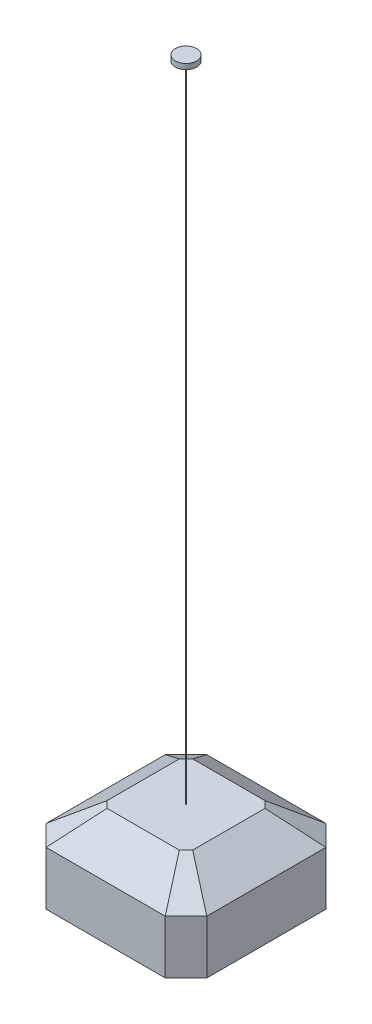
ISO-10303-21;
HEADER;
FILE_DESCRIPTION(('STEP AP214'),'2;1');
FILE_NAME('part.step','',(''),(''),'','','');
FILE_SCHEMA(('AUTOMOTIVE_DESIGN { 1 0 10303 214 1 1 1 1 }'));
ENDSEC;
DATA;
#1=APPLICATION_CONTEXT('core data for automotive mechanical design processes');
#2=APPLICATION_PROTOCOL_DEFINITION('international standard','automotive_design',2000,#1);
#3=PRODUCT_CONTEXT('',#1,'mechanical');
#4=PRODUCT('Part','Part','',(#3));
#5=PRODUCT_RELATED_PRODUCT_CATEGORY('part','',(#4));
#6=PRODUCT_DEFINITION_FORMATION('','',#4);
#7=PRODUCT_DEFINITION_CONTEXT('part definition',#1,'design');
#8=PRODUCT_DEFINITION('design','',#6,#7);
#9=PRODUCT_DEFINITION_SHAPE('','',#8);
#10=(LENGTH_UNIT() NAMED_UNIT(*) SI_UNIT(.MILLI.,.METRE.));
#11=(NAMED_UNIT(*) PLANE_ANGLE_UNIT() SI_UNIT($,.RADIAN.));
#12=(NAMED_UNIT(*) SI_UNIT($,.STERADIAN.) SOLID_ANGLE_UNIT());
#13=UNCERTAINTY_MEASURE_WITH_UNIT(LENGTH_MEASURE(1.E-05),#10,'distance_accuracy_value','');
#14=(GEOMETRIC_REPRESENTATION_CONTEXT(3) GLOBAL_UNCERTAINTY_ASSIGNED_CONTEXT((#13)) GLOBAL_UNIT_ASSIGNED_CONTEXT((#10,
#11,#12)) REPRESENTATION_CONTEXT('',''));
#15=CARTESIAN_POINT('',(0.,0.,0.));
#16=DIRECTION('',(0.,0.,1.));
#17=DIRECTION('',(1.,0.,0.));
#18=AXIS2_PLACEMENT_3D('',#15,#16,#17);
#19=CARTESIAN_POINT('',(0.,0.,0.));
#20=DIRECTION('',(0.,1.,0.));
#21=DIRECTION('',(0.,0.,1.));
#22=AXIS2_PLACEMENT_3D('',#19,#20,#21);
#23=PLANE('',#22);
#24=DIRECTION('',(-0.707106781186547,0.,-0.707106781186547));
#25=VECTOR('',#24,1.);
#26=CARTESIAN_POINT('',(160.,0.,-135.));
#27=LINE('',#26,#25);
#28=CARTESIAN_POINT('',(160.,0.,-135.));
#29=VERTEX_POINT('',#28);
#30=CARTESIAN_POINT('',(135.,0.,-160.));
#31=VERTEX_POINT('',#30);
#32=EDGE_CURVE('E412',#29,#31,#27,.T.);
#33=ORIENTED_EDGE('',*,*,#32,.F.);
#34=DIRECTION('',(0.,0.,-1.));
#35=VECTOR('',#34,1.);
#36=CARTESIAN_POINT('',(160.,0.,135.));
#37=LINE('',#36,#35);
#38=CARTESIAN_POINT('',(160.,0.,135.));
#39=VERTEX_POINT('',#38);
#40=EDGE_CURVE('E751',#39,#29,#37,.T.);
#41=ORIENTED_EDGE('',*,*,#40,.F.);
#42=DIRECTION('',(0.707106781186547,0.,-0.707106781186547));
#43=VECTOR('',#42,1.);
#44=CARTESIAN_POINT('',(135.,0.,160.));
#45=LINE('',#44,#43);
#46=CARTESIAN_POINT('',(135.,0.,160.));
#47=VERTEX_POINT('',#46);
#48=EDGE_CURVE('E854',#47,#39,#45,.T.);
#49=ORIENTED_EDGE('',*,*,#48,.F.);
#50=DIRECTION('',(1.,0.,0.));
#51=VECTOR('',#50,1.);
#52=CARTESIAN_POINT('',(-135.,0.,160.));
#53=LINE('',#52,#51);
#54=CARTESIAN_POINT('',(-135.,0.,160.));
#55=VERTEX_POINT('',#54);
#56=EDGE_CURVE('E871',#55,#47,#53,.T.);
#57=ORIENTED_EDGE('',*,*,#56,.F.);
#58=DIRECTION('',(0.707106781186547,0.,0.707106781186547));
#59=VECTOR('',#58,1.);
#60=CARTESIAN_POINT('',(-160.,0.,135.));
#61=LINE('',#60,#59);
#62=CARTESIAN_POINT('',(-160.,0.,135.));
#63=VERTEX_POINT('',#62);
#64=EDGE_CURVE('E875',#63,#55,#61,.T.);
#65=ORIENTED_EDGE('',*,*,#64,.F.);
#66=DIRECTION('',(0.,0.,1.));
#67=VECTOR('',#66,1.);
#68=CARTESIAN_POINT('',(-160.,0.,-135.));
#69=LINE('',#68,#67);
#70=CARTESIAN_POINT('',(-160.,0.,-135.));
#71=VERTEX_POINT('',#70);
#72=EDGE_CURVE('E893',#71,#63,#69,.T.);
#73=ORIENTED_EDGE('',*,*,#72,.F.);
#74=DIRECTION('',(-0.707106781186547,0.,0.707106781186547));
#75=VECTOR('',#74,1.);
#76=CARTESIAN_POINT('',(-135.,0.,-160.));
#77=LINE('',#76,#75);
#78=CARTESIAN_POINT('',(-135.,0.,-160.));
#79=VERTEX_POINT('',#78);
#80=EDGE_CURVE('E897',#79,#71,#77,.T.);
#81=ORIENTED_EDGE('',*,*,#80,.F.);
#82=DIRECTION('',(-1.,0.,0.));
#83=VECTOR('',#82,1.);
#84=CARTESIAN_POINT('',(135.,0.,-160.));
#85=LINE('',#84,#83);
#86=EDGE_CURVE('E754',#31,#79,#85,.T.);
#87=ORIENTED_EDGE('',*,*,#86,.F.);
#88=EDGE_LOOP('',(#33,#41,#49,#57,#65,#73,#81,#87));
#89=FACE_BOUND('',#88,.T.);
#90=ADVANCED_FACE('F89',(#89),#23,.F.);
#91=CARTESIAN_POINT('',(-41.1260485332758,-93.5386582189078,-41.1260485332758));
#92=DIRECTION('',(0.373376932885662,0.849222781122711,0.373376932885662));
#93=DIRECTION('',(0.,-0.402484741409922,0.915426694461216));
#94=AXIS2_PLACEMENT_3D('',#91,#92,#93);
#95=PLANE('',#94);
#96=DIRECTION('',(-0.72541369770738,0.518152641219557,-0.453092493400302));
#97=VECTOR('',#96,1.);
#98=CARTESIAN_POINT('',(-160.,0.,-135.));
#99=LINE('',#98,#97);
#100=CARTESIAN_POINT('',(-300.,100.,-222.443825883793));
#101=VERTEX_POINT('',#100);
#102=EDGE_CURVE('E853',#71,#101,#99,.T.);
#103=ORIENTED_EDGE('',*,*,#102,.T.);
#104=DIRECTION('',(-0.707106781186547,0.,0.707106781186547));
#105=VECTOR('',#104,1.);
#106=CARTESIAN_POINT('',(-222.443825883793,100.,-300.));
#107=LINE('',#106,#105);
#108=CARTESIAN_POINT('',(-222.443825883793,100.,-300.));
#109=VERTEX_POINT('',#108);
#110=EDGE_CURVE('E794',#109,#101,#107,.T.);
#111=ORIENTED_EDGE('',*,*,#110,.F.);
#112=DIRECTION('',(-0.453092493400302,0.518152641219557,-0.72541369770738));
#113=VECTOR('',#112,1.);
#114=CARTESIAN_POINT('',(-135.,0.,-160.));
#115=LINE('',#114,#113);
#116=EDGE_CURVE('E925',#79,#109,#115,.T.);
#117=ORIENTED_EDGE('',*,*,#116,.F.);
#118=ORIENTED_EDGE('',*,*,#80,.T.);
#119=EDGE_LOOP('',(#103,#111,#117,#118));
#120=FACE_BOUND('',#119,.T.);
#121=ADVANCED_FACE('F740',(#120),#95,.F.);
#122=CARTESIAN_POINT('',(0.,-75.6756756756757,-54.0540540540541));
#123=DIRECTION('',(0.,0.813733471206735,0.581238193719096));
#124=DIRECTION('',(0.,-0.581238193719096,0.813733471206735));
#125=AXIS2_PLACEMENT_3D('',#122,#123,#124);
#126=PLANE('',#125);
#127=ORIENTED_EDGE('',*,*,#116,.T.);
#128=DIRECTION('',(-1.,0.,0.));
#129=VECTOR('',#128,1.);
#130=CARTESIAN_POINT('',(222.443825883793,100.,-300.));
#131=LINE('',#130,#129);
#132=CARTESIAN_POINT('',(222.443825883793,100.,-300.));
#133=VERTEX_POINT('',#132);
#134=EDGE_CURVE('E117',#133,#109,#131,.T.);
#135=ORIENTED_EDGE('',*,*,#134,.F.);
#136=DIRECTION('',(0.453092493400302,0.518152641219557,-0.72541369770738));
#137=VECTOR('',#136,1.);
#138=CARTESIAN_POINT('',(135.,0.,-160.));
#139=LINE('',#138,#137);
#140=EDGE_CURVE('E808',#31,#133,#139,.T.);
#141=ORIENTED_EDGE('',*,*,#140,.F.);
#142=ORIENTED_EDGE('',*,*,#86,.T.);
#143=EDGE_LOOP('',(#127,#135,#141,#142));
#144=FACE_BOUND('',#143,.T.);
#145=ADVANCED_FACE('F745',(#144),#126,.F.);
#146=CARTESIAN_POINT('',(-54.054054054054,-75.6756756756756,0.));
#147=DIRECTION('',(0.581238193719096,0.813733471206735,0.));
#148=DIRECTION('',(-0.813733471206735,0.581238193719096,0.));
#149=AXIS2_PLACEMENT_3D('',#146,#147,#148);
#150=PLANE('',#149);
#151=DIRECTION('',(-0.72541369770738,0.518152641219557,0.453092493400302));
#152=VECTOR('',#151,1.);
#153=CARTESIAN_POINT('',(-160.,0.,135.));
#154=LINE('',#153,#152);
#155=CARTESIAN_POINT('',(-300.,100.,222.443825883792));
#156=VERTEX_POINT('',#155);
#157=EDGE_CURVE('E929',#63,#156,#154,.T.);
#158=ORIENTED_EDGE('',*,*,#157,.T.);
#159=DIRECTION('',(0.,0.,1.));
#160=VECTOR('',#159,1.);
#161=CARTESIAN_POINT('',(-300.,100.,-222.443825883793));
#162=LINE('',#161,#160);
#163=EDGE_CURVE('E788',#101,#156,#162,.T.);
#164=ORIENTED_EDGE('',*,*,#163,.F.);
#165=ORIENTED_EDGE('',*,*,#102,.F.);
#166=ORIENTED_EDGE('',*,*,#72,.T.);
#167=EDGE_LOOP('',(#158,#164,#165,#166));
#168=FACE_BOUND('',#167,.T.);
#169=ADVANCED_FACE('F955',(#168),#150,.F.);
#170=CARTESIAN_POINT('',(-41.1260485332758,-93.5386582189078,41.1260485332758));
#171=DIRECTION('',(0.373376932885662,0.84922278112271,-0.373376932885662));
#172=DIRECTION('',(0.,0.402484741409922,0.915426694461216));
#173=AXIS2_PLACEMENT_3D('',#170,#171,#172);
#174=PLANE('',#173);
#175=DIRECTION('',(-0.453092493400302,0.518152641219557,0.72541369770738));
#176=VECTOR('',#175,1.);
#177=CARTESIAN_POINT('',(-135.,0.,160.));
#178=LINE('',#177,#176);
#179=CARTESIAN_POINT('',(-222.443825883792,100.,300.));
#180=VERTEX_POINT('',#179);
#181=EDGE_CURVE('E934',#55,#180,#178,.T.);
#182=ORIENTED_EDGE('',*,*,#181,.T.);
#183=DIRECTION('',(0.707106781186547,0.,0.707106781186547));
#184=VECTOR('',#183,1.);
#185=CARTESIAN_POINT('',(-300.,100.,222.443825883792));
#186=LINE('',#185,#184);
#187=EDGE_CURVE('E782',#156,#180,#186,.T.);
#188=ORIENTED_EDGE('',*,*,#187,.F.);
#189=ORIENTED_EDGE('',*,*,#157,.F.);
#190=ORIENTED_EDGE('',*,*,#64,.T.);
#191=EDGE_LOOP('',(#182,#188,#189,#190));
#192=FACE_BOUND('',#191,.T.);
#193=ADVANCED_FACE('F958',(#192),#174,.F.);
#194=CARTESIAN_POINT('',(0.,-75.6756756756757,54.0540540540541));
#195=DIRECTION('',(0.,0.813733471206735,-0.581238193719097));
#196=DIRECTION('',(0.,0.581238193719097,0.813733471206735));
#197=AXIS2_PLACEMENT_3D('',#194,#195,#196);
#198=PLANE('',#197);
#199=DIRECTION('',(0.453092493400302,0.518152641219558,0.72541369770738));
#200=VECTOR('',#199,1.);
#201=CARTESIAN_POINT('',(135.,0.,160.));
#202=LINE('',#201,#200);
#203=CARTESIAN_POINT('',(222.443825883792,100.,300.));
#204=VERTEX_POINT('',#203);
#205=EDGE_CURVE('E988',#47,#204,#202,.T.);
#206=ORIENTED_EDGE('',*,*,#205,.T.);
#207=DIRECTION('',(1.,0.,0.));
#208=VECTOR('',#207,1.);
#209=CARTESIAN_POINT('',(-222.443825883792,100.,300.));
#210=LINE('',#209,#208);
#211=EDGE_CURVE('E776',#180,#204,#210,.T.);
#212=ORIENTED_EDGE('',*,*,#211,.F.);
#213=ORIENTED_EDGE('',*,*,#181,.F.);
#214=ORIENTED_EDGE('',*,*,#56,.T.);
#215=EDGE_LOOP('',(#206,#212,#213,#214));
#216=FACE_BOUND('',#215,.T.);
#217=ADVANCED_FACE('F833',(#216),#198,.F.);
#218=CARTESIAN_POINT('',(41.1260485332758,-93.5386582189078,41.1260485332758));
#219=DIRECTION('',(-0.373376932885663,0.84922278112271,-0.373376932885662));
#220=DIRECTION('',(-0.915426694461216,-0.402484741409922,0.));
#221=AXIS2_PLACEMENT_3D('',#218,#219,#220);
#222=PLANE('',#221);
#223=DIRECTION('',(0.72541369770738,0.518152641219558,0.453092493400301));
#224=VECTOR('',#223,1.);
#225=CARTESIAN_POINT('',(160.,0.,135.));
#226=LINE('',#225,#224);
#227=CARTESIAN_POINT('',(300.,100.,222.443825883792));
#228=VERTEX_POINT('',#227);
#229=EDGE_CURVE('E109',#39,#228,#226,.T.);
#230=ORIENTED_EDGE('',*,*,#229,.T.);
#231=DIRECTION('',(0.707106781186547,0.,-0.707106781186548));
#232=VECTOR('',#231,1.);
#233=CARTESIAN_POINT('',(222.443825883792,100.,300.));
#234=LINE('',#233,#232);
#235=EDGE_CURVE('E101',#204,#228,#234,.T.);
#236=ORIENTED_EDGE('',*,*,#235,.F.);
#237=ORIENTED_EDGE('',*,*,#205,.F.);
#238=ORIENTED_EDGE('',*,*,#48,.T.);
#239=EDGE_LOOP('',(#230,#236,#237,#238));
#240=FACE_BOUND('',#239,.T.);
#241=ADVANCED_FACE('F829',(#240),#222,.F.);
#242=CARTESIAN_POINT('',(54.054054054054,-75.6756756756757,0.));
#243=DIRECTION('',(-0.581238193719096,0.813733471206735,0.));
#244=DIRECTION('',(-0.813733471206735,-0.581238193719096,0.));
#245=AXIS2_PLACEMENT_3D('',#242,#243,#244);
#246=PLANE('',#245);
#247=DIRECTION('',(0.72541369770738,0.518152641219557,-0.453092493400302));
#248=VECTOR('',#247,1.);
#249=CARTESIAN_POINT('',(160.,0.,-135.));
#250=LINE('',#249,#248);
#251=CARTESIAN_POINT('',(300.,100.,-222.443825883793));
#252=VERTEX_POINT('',#251);
#253=EDGE_CURVE('E1006',#29,#252,#250,.T.);
#254=ORIENTED_EDGE('',*,*,#253,.T.);
#255=DIRECTION('',(0.,0.,-1.));
#256=VECTOR('',#255,1.);
#257=CARTESIAN_POINT('',(300.,100.,222.443825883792));
#258=LINE('',#257,#256);
#259=EDGE_CURVE('E12',#228,#252,#258,.T.);
#260=ORIENTED_EDGE('',*,*,#259,.F.);
#261=ORIENTED_EDGE('',*,*,#229,.F.);
#262=ORIENTED_EDGE('',*,*,#40,.T.);
#263=EDGE_LOOP('',(#254,#260,#261,#262));
#264=FACE_BOUND('',#263,.T.);
#265=ADVANCED_FACE('F820',(#264),#246,.F.);
#266=CARTESIAN_POINT('',(41.1260485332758,-93.5386582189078,-41.1260485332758));
#267=DIRECTION('',(-0.373376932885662,0.849222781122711,0.373376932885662));
#268=DIRECTION('',(0.,-0.402484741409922,0.915426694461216));
#269=AXIS2_PLACEMENT_3D('',#266,#267,#268);
#270=PLANE('',#269);
#271=ORIENTED_EDGE('',*,*,#140,.T.);
#272=DIRECTION('',(-0.707106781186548,0.,-0.707106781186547));
#273=VECTOR('',#272,1.);
#274=CARTESIAN_POINT('',(300.,100.,-222.443825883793));
#275=LINE('',#274,#273);
#276=EDGE_CURVE('E258',#252,#133,#275,.T.);
#277=ORIENTED_EDGE('',*,*,#276,.F.);
#278=ORIENTED_EDGE('',*,*,#253,.F.);
#279=ORIENTED_EDGE('',*,*,#32,.T.);
#280=EDGE_LOOP('',(#271,#277,#278,#279));
#281=FACE_BOUND('',#280,.T.);
#282=ADVANCED_FACE('F91',(#281),#270,.F.);
#283=CARTESIAN_POINT('',(-300.,0.,0.));
#284=DIRECTION('',(-1.,0.,0.));
#285=DIRECTION('',(0.,0.,1.));
#286=AXIS2_PLACEMENT_3D('',#283,#284,#285);
#287=PLANE('',#286);
#288=DIRECTION('',(0.,1.,0.));
#289=VECTOR('',#288,1.);
#290=CARTESIAN_POINT('',(-300.,100.,222.443825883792));
#291=LINE('',#290,#289);
#292=CARTESIAN_POINT('',(-300.,300.,222.443825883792));
#293=VERTEX_POINT('',#292);
#294=EDGE_CURVE('E279',#156,#293,#291,.T.);
#295=ORIENTED_EDGE('',*,*,#294,.T.);
#296=DIRECTION('',(0.,0.,-1.));
#297=VECTOR('',#296,1.);
#298=CARTESIAN_POINT('',(-300.,300.,222.443825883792));
#299=LINE('',#298,#297);
#300=CARTESIAN_POINT('',(-300.,300.,-222.443825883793));
#301=VERTEX_POINT('',#300);
#302=EDGE_CURVE('E413',#293,#301,#299,.T.);
#303=ORIENTED_EDGE('',*,*,#302,.T.);
#304=DIRECTION('',(0.,1.,0.));
#305=VECTOR('',#304,1.);
#306=CARTESIAN_POINT('',(-300.,100.,-222.443825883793));
#307=LINE('',#306,#305);
#308=EDGE_CURVE('E274',#101,#301,#307,.T.);
#309=ORIENTED_EDGE('',*,*,#308,.F.);
#310=ORIENTED_EDGE('',*,*,#163,.T.);
#311=EDGE_LOOP('',(#295,#303,#309,#310));
#312=FACE_BOUND('',#311,.T.);
#313=ADVANCED_FACE('F314',(#312),#287,.T.);
#314=CARTESIAN_POINT('',(-261.221912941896,0.,-261.221912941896));
#315=DIRECTION('',(-0.707106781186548,0.,-0.707106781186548));
#316=DIRECTION('',(-0.707106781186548,0.,0.707106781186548));
#317=AXIS2_PLACEMENT_3D('',#314,#315,#316);
#318=PLANE('',#317);
#319=ORIENTED_EDGE('',*,*,#308,.T.);
#320=DIRECTION('',(0.707106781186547,0.,-0.707106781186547));
#321=VECTOR('',#320,1.);
#322=CARTESIAN_POINT('',(-300.,300.,-222.443825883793));
#323=LINE('',#322,#321);
#324=CARTESIAN_POINT('',(-222.443825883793,300.,-300.));
#325=VERTEX_POINT('',#324);
#326=EDGE_CURVE('E296',#301,#325,#323,.T.);
#327=ORIENTED_EDGE('',*,*,#326,.T.);
#328=DIRECTION('',(0.,1.,0.));
#329=VECTOR('',#328,1.);
#330=CARTESIAN_POINT('',(-222.443825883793,100.,-300.));
#331=LINE('',#330,#329);
#332=EDGE_CURVE('E249',#109,#325,#331,.T.);
#333=ORIENTED_EDGE('',*,*,#332,.F.);
#334=ORIENTED_EDGE('',*,*,#110,.T.);
#335=EDGE_LOOP('',(#319,#327,#333,#334));
#336=FACE_BOUND('',#335,.T.);
#337=ADVANCED_FACE('F303',(#336),#318,.T.);
#338=CARTESIAN_POINT('',(-261.221912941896,0.,261.221912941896));
#339=DIRECTION('',(-0.707106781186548,0.,0.707106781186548));
#340=DIRECTION('',(0.707106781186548,0.,0.707106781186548));
#341=AXIS2_PLACEMENT_3D('',#338,#339,#340);
#342=PLANE('',#341);
#343=DIRECTION('',(0.,1.,0.));
#344=VECTOR('',#343,1.);
#345=CARTESIAN_POINT('',(-222.443825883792,100.,300.));
#346=LINE('',#345,#344);
#347=CARTESIAN_POINT('',(-222.443825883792,300.,300.));
#348=VERTEX_POINT('',#347);
#349=EDGE_CURVE('E278',#180,#348,#346,.T.);
#350=ORIENTED_EDGE('',*,*,#349,.T.);
#351=DIRECTION('',(-0.707106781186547,0.,-0.707106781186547));
#352=VECTOR('',#351,1.);
#353=CARTESIAN_POINT('',(-222.443825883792,300.,300.));
#354=LINE('',#353,#352);
#355=EDGE_CURVE('E416',#348,#293,#354,.T.);
#356=ORIENTED_EDGE('',*,*,#355,.T.);
#357=ORIENTED_EDGE('',*,*,#294,.F.);
#358=ORIENTED_EDGE('',*,*,#187,.T.);
#359=EDGE_LOOP('',(#350,#356,#357,#358));
#360=FACE_BOUND('',#359,.T.);
#361=ADVANCED_FACE('F313',(#360),#342,.T.);
#362=CARTESIAN_POINT('',(0.,0.,300.));
#363=DIRECTION('',(0.,0.,1.));
#364=DIRECTION('',(1.,0.,0.));
#365=AXIS2_PLACEMENT_3D('',#362,#363,#364);
#366=PLANE('',#365);
#367=DIRECTION('',(0.,1.,0.));
#368=VECTOR('',#367,1.);
#369=CARTESIAN_POINT('',(222.443825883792,100.,300.));
#370=LINE('',#369,#368);
#371=CARTESIAN_POINT('',(222.443825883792,300.,300.));
#372=VERTEX_POINT('',#371);
#373=EDGE_CURVE('E291',#204,#372,#370,.T.);
#374=ORIENTED_EDGE('',*,*,#373,.T.);
#375=DIRECTION('',(-1.,0.,0.));
#376=VECTOR('',#375,1.);
#377=CARTESIAN_POINT('',(222.443825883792,300.,300.));
#378=LINE('',#377,#376);
#379=EDGE_CURVE('E340',#372,#348,#378,.T.);
#380=ORIENTED_EDGE('',*,*,#379,.T.);
#381=ORIENTED_EDGE('',*,*,#349,.F.);
#382=ORIENTED_EDGE('',*,*,#211,.T.);
#383=EDGE_LOOP('',(#374,#380,#381,#382));
#384=FACE_BOUND('',#383,.T.);
#385=ADVANCED_FACE('F320',(#384),#366,.T.);
#386=CARTESIAN_POINT('',(261.221912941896,0.,261.221912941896));
#387=DIRECTION('',(0.707106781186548,0.,0.707106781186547));
#388=DIRECTION('',(0.707106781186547,0.,-0.707106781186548));
#389=AXIS2_PLACEMENT_3D('',#386,#387,#388);
#390=PLANE('',#389);
#391=DIRECTION('',(0.,1.,0.));
#392=VECTOR('',#391,1.);
#393=CARTESIAN_POINT('',(300.,100.,222.443825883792));
#394=LINE('',#393,#392);
#395=CARTESIAN_POINT('',(300.,300.,222.443825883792));
#396=VERTEX_POINT('',#395);
#397=EDGE_CURVE('E265',#228,#396,#394,.T.);
#398=ORIENTED_EDGE('',*,*,#397,.T.);
#399=DIRECTION('',(-0.707106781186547,0.,0.707106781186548));
#400=VECTOR('',#399,1.);
#401=CARTESIAN_POINT('',(300.,300.,222.443825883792));
#402=LINE('',#401,#400);
#403=EDGE_CURVE('E354',#396,#372,#402,.T.);
#404=ORIENTED_EDGE('',*,*,#403,.T.);
#405=ORIENTED_EDGE('',*,*,#373,.F.);
#406=ORIENTED_EDGE('',*,*,#235,.T.);
#407=EDGE_LOOP('',(#398,#404,#405,#406));
#408=FACE_BOUND('',#407,.T.);
#409=ADVANCED_FACE('F360',(#408),#390,.T.);
#410=CARTESIAN_POINT('',(300.,0.,1.1229809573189E-13));
#411=DIRECTION('',(1.,0.,0.));
#412=DIRECTION('',(0.,0.,-1.));
#413=AXIS2_PLACEMENT_3D('',#410,#411,#412);
#414=PLANE('',#413);
#415=DIRECTION('',(0.,1.,0.));
#416=VECTOR('',#415,1.);
#417=CARTESIAN_POINT('',(300.,100.,-222.443825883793));
#418=LINE('',#417,#416);
#419=CARTESIAN_POINT('',(300.,300.,-222.443825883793));
#420=VERTEX_POINT('',#419);
#421=EDGE_CURVE('E260',#252,#420,#418,.T.);
#422=ORIENTED_EDGE('',*,*,#421,.T.);
#423=DIRECTION('',(0.,0.,1.));
#424=VECTOR('',#423,1.);
#425=CARTESIAN_POINT('',(300.,300.,-222.443825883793));
#426=LINE('',#425,#424);
#427=EDGE_CURVE('E94',#420,#396,#426,.T.);
#428=ORIENTED_EDGE('',*,*,#427,.T.);
#429=ORIENTED_EDGE('',*,*,#397,.F.);
#430=ORIENTED_EDGE('',*,*,#259,.T.);
#431=EDGE_LOOP('',(#422,#428,#429,#430));
#432=FACE_BOUND('',#431,.T.);
#433=ADVANCED_FACE('F369',(#432),#414,.T.);
#434=CARTESIAN_POINT('',(261.221912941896,0.,-261.221912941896));
#435=DIRECTION('',(0.707106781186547,0.,-0.707106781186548));
#436=DIRECTION('',(-0.707106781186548,0.,-0.707106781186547));
#437=AXIS2_PLACEMENT_3D('',#434,#435,#436);
#438=PLANE('',#437);
#439=DIRECTION('',(0.,1.,0.));
#440=VECTOR('',#439,1.);
#441=CARTESIAN_POINT('',(222.443825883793,100.,-300.));
#442=LINE('',#441,#440);
#443=CARTESIAN_POINT('',(222.443825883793,300.,-300.));
#444=VERTEX_POINT('',#443);
#445=EDGE_CURVE('E247',#133,#444,#442,.T.);
#446=ORIENTED_EDGE('',*,*,#445,.T.);
#447=DIRECTION('',(0.707106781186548,0.,0.707106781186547));
#448=VECTOR('',#447,1.);
#449=CARTESIAN_POINT('',(222.443825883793,300.,-300.));
#450=LINE('',#449,#448);
#451=EDGE_CURVE('E211',#444,#420,#450,.T.);
#452=ORIENTED_EDGE('',*,*,#451,.T.);
#453=ORIENTED_EDGE('',*,*,#421,.F.);
#454=ORIENTED_EDGE('',*,*,#276,.T.);
#455=EDGE_LOOP('',(#446,#452,#453,#454));
#456=FACE_BOUND('',#455,.T.);
#457=ADVANCED_FACE('F256',(#456),#438,.T.);
#458=CARTESIAN_POINT('',(0.,0.,-300.));
#459=DIRECTION('',(0.,0.,-1.));
#460=DIRECTION('',(0.,1.,0.));
#461=AXIS2_PLACEMENT_3D('',#458,#459,#460);
#462=PLANE('',#461);
#463=ORIENTED_EDGE('',*,*,#332,.T.);
#464=DIRECTION('',(1.,0.,0.));
#465=VECTOR('',#464,1.);
#466=CARTESIAN_POINT('',(-222.443825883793,300.,-300.));
#467=LINE('',#466,#465);
#468=EDGE_CURVE('E226',#325,#444,#467,.T.);
#469=ORIENTED_EDGE('',*,*,#468,.T.);
#470=ORIENTED_EDGE('',*,*,#445,.F.);
#471=ORIENTED_EDGE('',*,*,#134,.T.);
#472=EDGE_LOOP('',(#463,#469,#470,#471));
#473=FACE_BOUND('',#472,.T.);
#474=ADVANCED_FACE('F246',(#473),#462,.T.);
#475=CARTESIAN_POINT('',(0.,400.,0.));
#476=DIRECTION('',(0.,1.,0.));
#477=DIRECTION('',(0.,0.,1.));
#478=AXIS2_PLACEMENT_3D('',#475,#476,#477);
#479=PLANE('',#478);
#480=CARTESIAN_POINT('',(0.,400.,0.));
#481=DIRECTION('',(0.,-1.,0.));
#482=DIRECTION('',(1.,0.,0.));
#483=AXIS2_PLACEMENT_3D('',#480,#481,#482);
#484=CIRCLE('',#483,1.00000000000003);
#485=CARTESIAN_POINT('',(1.00000000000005,400.,0.));
#486=VERTEX_POINT('',#485);
#487=EDGE_CURVE('E698',#486,#486,#484,.T.);
#488=ORIENTED_EDGE('',*,*,#487,.T.);
#489=EDGE_LOOP('',(#488));
#490=FACE_BOUND('',#489,.T.);
#491=DIRECTION('',(-0.707106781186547,0.,-0.707106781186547));
#492=VECTOR('',#491,1.);
#493=CARTESIAN_POINT('',(160.,400.,-135.));
#494=LINE('',#493,#492);
#495=CARTESIAN_POINT('',(160.,400.,-135.));
#496=VERTEX_POINT('',#495);
#497=CARTESIAN_POINT('',(135.,400.,-160.));
#498=VERTEX_POINT('',#497);
#499=EDGE_CURVE('E507',#496,#498,#494,.T.);
#500=ORIENTED_EDGE('',*,*,#499,.T.);
#501=DIRECTION('',(-1.,0.,0.));
#502=VECTOR('',#501,1.);
#503=CARTESIAN_POINT('',(135.,400.,-160.));
#504=LINE('',#503,#502);
#505=CARTESIAN_POINT('',(-135.,400.,-160.));
#506=VERTEX_POINT('',#505);
#507=EDGE_CURVE('E237',#498,#506,#504,.T.);
#508=ORIENTED_EDGE('',*,*,#507,.T.);
#509=DIRECTION('',(-0.707106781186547,0.,0.707106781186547));
#510=VECTOR('',#509,1.);
#511=CARTESIAN_POINT('',(-135.,400.,-160.));
#512=LINE('',#511,#510);
#513=CARTESIAN_POINT('',(-160.,400.,-135.));
#514=VERTEX_POINT('',#513);
#515=EDGE_CURVE('E506',#506,#514,#512,.T.);
#516=ORIENTED_EDGE('',*,*,#515,.T.);
#517=DIRECTION('',(0.,0.,1.));
#518=VECTOR('',#517,1.);
#519=CARTESIAN_POINT('',(-160.,400.,-135.));
#520=LINE('',#519,#518);
#521=CARTESIAN_POINT('',(-160.,400.,135.));
#522=VERTEX_POINT('',#521);
#523=EDGE_CURVE('E512',#514,#522,#520,.T.);
#524=ORIENTED_EDGE('',*,*,#523,.T.);
#525=DIRECTION('',(0.707106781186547,0.,0.707106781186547));
#526=VECTOR('',#525,1.);
#527=CARTESIAN_POINT('',(-160.,400.,135.));
#528=LINE('',#527,#526);
#529=CARTESIAN_POINT('',(-135.,400.,160.));
#530=VERTEX_POINT('',#529);
#531=EDGE_CURVE('E579',#522,#530,#528,.T.);
#532=ORIENTED_EDGE('',*,*,#531,.T.);
#533=DIRECTION('',(1.,0.,0.));
#534=VECTOR('',#533,1.);
#535=CARTESIAN_POINT('',(-135.,400.,160.));
#536=LINE('',#535,#534);
#537=CARTESIAN_POINT('',(135.,400.,160.));
#538=VERTEX_POINT('',#537);
#539=EDGE_CURVE('E593',#530,#538,#536,.T.);
#540=ORIENTED_EDGE('',*,*,#539,.T.);
#541=DIRECTION('',(0.707106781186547,0.,-0.707106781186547));
#542=VECTOR('',#541,1.);
#543=CARTESIAN_POINT('',(135.,400.,160.));
#544=LINE('',#543,#542);
#545=CARTESIAN_POINT('',(160.,400.,135.));
#546=VERTEX_POINT('',#545);
#547=EDGE_CURVE('E1036',#538,#546,#544,.T.);
#548=ORIENTED_EDGE('',*,*,#547,.T.);
#549=DIRECTION('',(0.,0.,-1.));
#550=VECTOR('',#549,1.);
#551=CARTESIAN_POINT('',(160.,400.,135.));
#552=LINE('',#551,#550);
#553=EDGE_CURVE('E285',#546,#496,#552,.T.);
#554=ORIENTED_EDGE('',*,*,#553,.T.);
#555=EDGE_LOOP('',(#500,#508,#516,#524,#532,#540,#548,#554));
#556=FACE_BOUND('',#555,.T.);
#557=ADVANCED_FACE('F394',(#490,#556),#479,.T.);
#558=CARTESIAN_POINT('',(-243.243243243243,340.540540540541,0.));
#559=DIRECTION('',(0.581238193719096,-0.813733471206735,0.));
#560=DIRECTION('',(0.813733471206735,0.581238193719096,0.));
#561=AXIS2_PLACEMENT_3D('',#558,#559,#560);
#562=PLANE('',#561);
#563=DIRECTION('',(0.72541369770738,0.518152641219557,-0.453092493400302));
#564=VECTOR('',#563,1.);
#565=CARTESIAN_POINT('',(-300.,300.,222.443825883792));
#566=LINE('',#565,#564);
#567=EDGE_CURVE('E677',#293,#522,#566,.T.);
#568=ORIENTED_EDGE('',*,*,#567,.T.);
#569=ORIENTED_EDGE('',*,*,#523,.F.);
#570=DIRECTION('',(0.72541369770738,0.518152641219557,0.453092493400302));
#571=VECTOR('',#570,1.);
#572=CARTESIAN_POINT('',(-300.,300.,-222.443825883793));
#573=LINE('',#572,#571);
#574=EDGE_CURVE('E523',#301,#514,#573,.T.);
#575=ORIENTED_EDGE('',*,*,#574,.F.);
#576=ORIENTED_EDGE('',*,*,#302,.F.);
#577=EDGE_LOOP('',(#568,#569,#575,#576));
#578=FACE_BOUND('',#577,.T.);
#579=ADVANCED_FACE('F454',(#578),#562,.F.);
#580=CARTESIAN_POINT('',(-167.958127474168,382.010391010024,-167.958127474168));
#581=DIRECTION('',(0.373376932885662,-0.849222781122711,0.373376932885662));
#582=DIRECTION('',(0.,-0.402484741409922,-0.915426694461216));
#583=AXIS2_PLACEMENT_3D('',#580,#581,#582);
#584=PLANE('',#583);
#585=ORIENTED_EDGE('',*,*,#574,.T.);
#586=ORIENTED_EDGE('',*,*,#515,.F.);
#587=DIRECTION('',(0.453092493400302,0.518152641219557,0.72541369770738));
#588=VECTOR('',#587,1.);
#589=CARTESIAN_POINT('',(-222.443825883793,300.,-300.));
#590=LINE('',#589,#588);
#591=EDGE_CURVE('E240',#325,#506,#590,.T.);
#592=ORIENTED_EDGE('',*,*,#591,.F.);
#593=ORIENTED_EDGE('',*,*,#326,.F.);
#594=EDGE_LOOP('',(#585,#586,#592,#593));
#595=FACE_BOUND('',#594,.T.);
#596=ADVANCED_FACE('F521',(#595),#584,.F.);
#597=CARTESIAN_POINT('',(-167.958127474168,382.010391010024,167.958127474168));
#598=DIRECTION('',(0.373376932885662,-0.849222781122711,-0.373376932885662));
#599=DIRECTION('',(0.,0.402484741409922,-0.915426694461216));
#600=AXIS2_PLACEMENT_3D('',#597,#598,#599);
#601=PLANE('',#600);
#602=DIRECTION('',(0.453092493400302,0.518152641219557,-0.72541369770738));
#603=VECTOR('',#602,1.);
#604=CARTESIAN_POINT('',(-222.443825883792,300.,300.));
#605=LINE('',#604,#603);
#606=EDGE_CURVE('E626',#348,#530,#605,.T.);
#607=ORIENTED_EDGE('',*,*,#606,.T.);
#608=ORIENTED_EDGE('',*,*,#531,.F.);
#609=ORIENTED_EDGE('',*,*,#567,.F.);
#610=ORIENTED_EDGE('',*,*,#355,.F.);
#611=EDGE_LOOP('',(#607,#608,#609,#610));
#612=FACE_BOUND('',#611,.T.);
#613=ADVANCED_FACE('F550',(#612),#601,.F.);
#614=CARTESIAN_POINT('',(0.,340.540540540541,243.243243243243));
#615=DIRECTION('',(0.,-0.813733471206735,-0.581238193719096));
#616=DIRECTION('',(0.,0.581238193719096,-0.813733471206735));
#617=AXIS2_PLACEMENT_3D('',#614,#615,#616);
#618=PLANE('',#617);
#619=DIRECTION('',(-0.453092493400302,0.518152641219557,-0.72541369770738));
#620=VECTOR('',#619,1.);
#621=CARTESIAN_POINT('',(222.443825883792,300.,300.));
#622=LINE('',#621,#620);
#623=EDGE_CURVE('E617',#372,#538,#622,.T.);
#624=ORIENTED_EDGE('',*,*,#623,.T.);
#625=ORIENTED_EDGE('',*,*,#539,.F.);
#626=ORIENTED_EDGE('',*,*,#606,.F.);
#627=ORIENTED_EDGE('',*,*,#379,.F.);
#628=EDGE_LOOP('',(#624,#625,#626,#627));
#629=FACE_BOUND('',#628,.T.);
#630=ADVANCED_FACE('F598',(#629),#618,.F.);
#631=CARTESIAN_POINT('',(167.958127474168,382.010391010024,167.958127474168));
#632=DIRECTION('',(-0.373376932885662,-0.849222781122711,-0.373376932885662));
#633=DIRECTION('',(0.,0.402484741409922,-0.915426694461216));
#634=AXIS2_PLACEMENT_3D('',#631,#632,#633);
#635=PLANE('',#634);
#636=DIRECTION('',(-0.72541369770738,0.518152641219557,-0.453092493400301));
#637=VECTOR('',#636,1.);
#638=CARTESIAN_POINT('',(300.,300.,222.443825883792));
#639=LINE('',#638,#637);
#640=EDGE_CURVE('E625',#396,#546,#639,.T.);
#641=ORIENTED_EDGE('',*,*,#640,.T.);
#642=ORIENTED_EDGE('',*,*,#547,.F.);
#643=ORIENTED_EDGE('',*,*,#623,.F.);
#644=ORIENTED_EDGE('',*,*,#403,.F.);
#645=EDGE_LOOP('',(#641,#642,#643,#644));
#646=FACE_BOUND('',#645,.T.);
#647=ADVANCED_FACE('F607',(#646),#635,.F.);
#648=CARTESIAN_POINT('',(243.243243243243,340.540540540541,1.00020092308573E-13));
#649=DIRECTION('',(-0.581238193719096,-0.813733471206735,0.));
#650=DIRECTION('',(0.813733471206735,-0.581238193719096,0.));
#651=AXIS2_PLACEMENT_3D('',#648,#649,#650);
#652=PLANE('',#651);
#653=DIRECTION('',(-0.72541369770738,0.518152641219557,0.453092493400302));
#654=VECTOR('',#653,1.);
#655=CARTESIAN_POINT('',(300.,300.,-222.443825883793));
#656=LINE('',#655,#654);
#657=EDGE_CURVE('E219',#420,#496,#656,.T.);
#658=ORIENTED_EDGE('',*,*,#657,.T.);
#659=ORIENTED_EDGE('',*,*,#553,.F.);
#660=ORIENTED_EDGE('',*,*,#640,.F.);
#661=ORIENTED_EDGE('',*,*,#427,.F.);
#662=EDGE_LOOP('',(#658,#659,#660,#661));
#663=FACE_BOUND('',#662,.T.);
#664=ADVANCED_FACE('F647',(#663),#652,.F.);
#665=CARTESIAN_POINT('',(167.958127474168,382.010391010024,-167.958127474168));
#666=DIRECTION('',(-0.373376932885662,-0.849222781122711,0.373376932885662));
#667=DIRECTION('',(0.,-0.402484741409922,-0.915426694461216));
#668=AXIS2_PLACEMENT_3D('',#665,#666,#667);
#669=PLANE('',#668);
#670=DIRECTION('',(-0.453092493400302,0.518152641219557,0.72541369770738));
#671=VECTOR('',#670,1.);
#672=CARTESIAN_POINT('',(222.443825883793,300.,-300.));
#673=LINE('',#672,#671);
#674=EDGE_CURVE('E216',#444,#498,#673,.T.);
#675=ORIENTED_EDGE('',*,*,#674,.T.);
#676=ORIENTED_EDGE('',*,*,#499,.F.);
#677=ORIENTED_EDGE('',*,*,#657,.F.);
#678=ORIENTED_EDGE('',*,*,#451,.F.);
#679=EDGE_LOOP('',(#675,#676,#677,#678));
#680=FACE_BOUND('',#679,.T.);
#681=ADVANCED_FACE('F214',(#680),#669,.F.);
#682=CARTESIAN_POINT('',(0.,340.540540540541,-243.243243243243));
#683=DIRECTION('',(0.,-0.813733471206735,0.581238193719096));
#684=DIRECTION('',(0.,-0.581238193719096,-0.813733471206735));
#685=AXIS2_PLACEMENT_3D('',#682,#683,#684);
#686=PLANE('',#685);
#687=ORIENTED_EDGE('',*,*,#591,.T.);
#688=ORIENTED_EDGE('',*,*,#507,.F.);
#689=ORIENTED_EDGE('',*,*,#674,.F.);
#690=ORIENTED_EDGE('',*,*,#468,.F.);
#691=EDGE_LOOP('',(#687,#688,#689,#690));
#692=FACE_BOUND('',#691,.T.);
#693=ADVANCED_FACE('F233',(#692),#686,.F.);
#694=CARTESIAN_POINT('',(0.,2825.,0.));
#695=DIRECTION('',(0.,-1.,0.));
#696=DIRECTION('',(1.,0.,0.));
#697=AXIS2_PLACEMENT_3D('',#694,#695,#696);
#698=PLANE('',#697);
#699=CARTESIAN_POINT('',(0.,2825.,0.));
#700=DIRECTION('',(0.,-1.,0.));
#701=DIRECTION('',(1.,0.,0.));
#702=AXIS2_PLACEMENT_3D('',#699,#700,#701);
#703=CIRCLE('',#702,40.);
#704=CARTESIAN_POINT('',(40.,2825.,0.));
#705=VERTEX_POINT('',#704);
#706=EDGE_CURVE('E679',#705,#705,#703,.T.);
#707=ORIENTED_EDGE('',*,*,#706,.F.);
#708=EDGE_LOOP('',(#707));
#709=FACE_BOUND('',#708,.T.);
#710=ADVANCED_FACE('F731',(#709),#698,.F.);
#711=CARTESIAN_POINT('',(0.,400.,0.));
#712=DIRECTION('',(0.,-1.,0.));
#713=DIRECTION('',(1.,0.,0.));
#714=AXIS2_PLACEMENT_3D('',#711,#712,#713);
#715=CYLINDRICAL_SURFACE('',#714,40.);
#716=CARTESIAN_POINT('',(0.,2805.,0.));
#717=DIRECTION('',(0.,-1.,0.));
#718=DIRECTION('',(1.,0.,0.));
#719=AXIS2_PLACEMENT_3D('',#716,#717,#718);
#720=CIRCLE('',#719,40.);
#721=CARTESIAN_POINT('',(40.,2805.,0.));
#722=VERTEX_POINT('',#721);
#723=EDGE_CURVE('E683',#722,#722,#720,.T.);
#724=ORIENTED_EDGE('',*,*,#723,.F.);
#725=EDGE_LOOP('',(#724));
#726=FACE_BOUND('',#725,.T.);
#727=ORIENTED_EDGE('',*,*,#706,.T.);
#728=EDGE_LOOP('',(#727));
#729=FACE_BOUND('',#728,.T.);
#730=ADVANCED_FACE('F725',(#726,#729),#715,.T.);
#731=CARTESIAN_POINT('',(-40.,2805.,0.));
#732=DIRECTION('',(0.,1.,0.));
#733=DIRECTION('',(-1.,0.,0.));
#734=AXIS2_PLACEMENT_3D('',#731,#732,#733);
#735=PLANE('',#734);
#736=CARTESIAN_POINT('',(0.,2805.,0.));
#737=DIRECTION('',(0.,-1.,0.));
#738=DIRECTION('',(1.,0.,0.));
#739=AXIS2_PLACEMENT_3D('',#736,#737,#738);
#740=CIRCLE('',#739,5.);
#741=CARTESIAN_POINT('',(5.,2805.,0.));
#742=VERTEX_POINT('',#741);
#743=EDGE_CURVE('E686',#742,#742,#740,.T.);
#744=ORIENTED_EDGE('',*,*,#743,.F.);
#745=EDGE_LOOP('',(#744));
#746=FACE_BOUND('',#745,.T.);
#747=ORIENTED_EDGE('',*,*,#723,.T.);
#748=EDGE_LOOP('',(#747));
#749=FACE_BOUND('',#748,.T.);
#750=ADVANCED_FACE('F719',(#746,#749),#735,.F.);
#751=CARTESIAN_POINT('',(0.,400.,0.));
#752=DIRECTION('',(0.,-1.,0.));
#753=DIRECTION('',(1.,0.,0.));
#754=AXIS2_PLACEMENT_3D('',#751,#752,#753);
#755=CYLINDRICAL_SURFACE('',#754,5.);
#756=CARTESIAN_POINT('',(0.,2800.,0.));
#757=DIRECTION('',(0.,-1.,0.));
#758=DIRECTION('',(1.,0.,0.));
#759=AXIS2_PLACEMENT_3D('',#756,#757,#758);
#760=CIRCLE('',#759,5.);
#761=CARTESIAN_POINT('',(5.,2800.,0.));
#762=VERTEX_POINT('',#761);
#763=EDGE_CURVE('E690',#762,#762,#760,.T.);
#764=ORIENTED_EDGE('',*,*,#763,.F.);
#765=EDGE_LOOP('',(#764));
#766=FACE_BOUND('',#765,.T.);
#767=ORIENTED_EDGE('',*,*,#743,.T.);
#768=EDGE_LOOP('',(#767));
#769=FACE_BOUND('',#768,.T.);
#770=ADVANCED_FACE('F713',(#766,#769),#755,.T.);
#771=CARTESIAN_POINT('',(-5.,2800.,0.));
#772=DIRECTION('',(0.,1.,0.));
#773=DIRECTION('',(-1.,0.,0.));
#774=AXIS2_PLACEMENT_3D('',#771,#772,#773);
#775=PLANE('',#774);
#776=CARTESIAN_POINT('',(0.,2800.,0.));
#777=DIRECTION('',(0.,-1.,0.));
#778=DIRECTION('',(1.,0.,0.));
#779=AXIS2_PLACEMENT_3D('',#776,#777,#778);
#780=CIRCLE('',#779,0.999999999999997);
#781=CARTESIAN_POINT('',(0.999999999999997,2800.,0.));
#782=VERTEX_POINT('',#781);
#783=EDGE_CURVE('E694',#782,#782,#780,.T.);
#784=ORIENTED_EDGE('',*,*,#783,.F.);
#785=EDGE_LOOP('',(#784));
#786=FACE_BOUND('',#785,.T.);
#787=ORIENTED_EDGE('',*,*,#763,.T.);
#788=EDGE_LOOP('',(#787));
#789=FACE_BOUND('',#788,.T.);
#790=ADVANCED_FACE('F707',(#786,#789),#775,.F.);
#791=CARTESIAN_POINT('',(0.,400.,0.));
#792=DIRECTION('',(0.,-1.,0.));
#793=DIRECTION('',(1.,0.,0.));
#794=AXIS2_PLACEMENT_3D('',#791,#792,#793);
#795=CYLINDRICAL_SURFACE('',#794,1.00000000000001);
#796=ORIENTED_EDGE('',*,*,#487,.F.);
#797=EDGE_LOOP('',(#796));
#798=FACE_BOUND('',#797,.T.);
#799=ORIENTED_EDGE('',*,*,#783,.T.);
#800=EDGE_LOOP('',(#799));
#801=FACE_BOUND('',#800,.T.);
#802=ADVANCED_FACE('F704',(#798,#801),#795,.T.);
#803=CLOSED_SHELL('',(#90,#121,#145,#169,#193,#217,#241,#265,#282,#313,#337,#361,#385,#409,#433,
#457,#474,#557,#579,#596,#613,#630,#647,#664,#681,#693,#710,#730,#750,#770,#790,#802));
#804=MANIFOLD_SOLID_BREP('B2',#803);
#805=ADVANCED_BREP_SHAPE_REPRESENTATION('',(#18,#804),#14);
#806=SHAPE_DEFINITION_REPRESENTATION(#9,#805);
ENDSEC;
END-ISO-10303-21;
